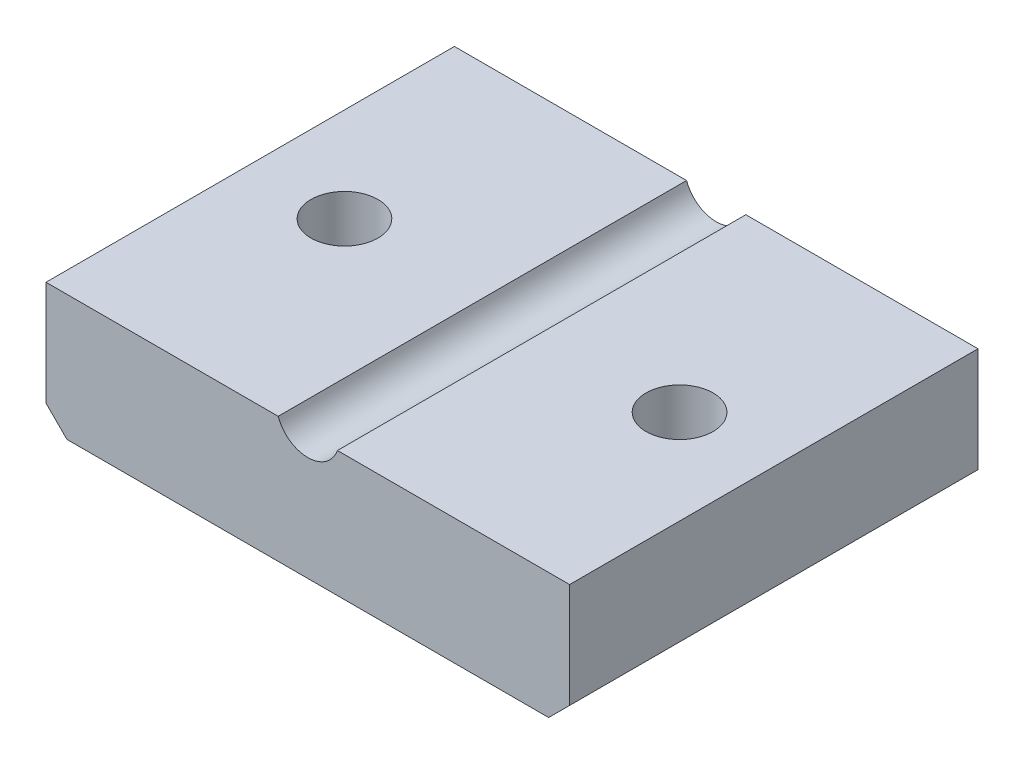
ISO-10303-21;
HEADER;
FILE_DESCRIPTION(('STEP AP214'),'2;1');
FILE_NAME('part.step','',(''),(''),'','','');
FILE_SCHEMA(('AUTOMOTIVE_DESIGN { 1 0 10303 214 1 1 1 1 }'));
ENDSEC;
DATA;
#1=APPLICATION_CONTEXT('core data for automotive mechanical design processes');
#2=APPLICATION_PROTOCOL_DEFINITION('international standard','automotive_design',2000,#1);
#3=PRODUCT_CONTEXT('',#1,'mechanical');
#4=PRODUCT('Part','Part','',(#3));
#5=PRODUCT_RELATED_PRODUCT_CATEGORY('part','',(#4));
#6=PRODUCT_DEFINITION_FORMATION('','',#4);
#7=PRODUCT_DEFINITION_CONTEXT('part definition',#1,'design');
#8=PRODUCT_DEFINITION('design','',#6,#7);
#9=PRODUCT_DEFINITION_SHAPE('','',#8);
#10=(LENGTH_UNIT() NAMED_UNIT(*) SI_UNIT(.MILLI.,.METRE.));
#11=(NAMED_UNIT(*) PLANE_ANGLE_UNIT() SI_UNIT($,.RADIAN.));
#12=(NAMED_UNIT(*) SI_UNIT($,.STERADIAN.) SOLID_ANGLE_UNIT());
#13=UNCERTAINTY_MEASURE_WITH_UNIT(LENGTH_MEASURE(1.E-05),#10,'distance_accuracy_value','');
#14=(GEOMETRIC_REPRESENTATION_CONTEXT(3) GLOBAL_UNCERTAINTY_ASSIGNED_CONTEXT((#13)) GLOBAL_UNIT_ASSIGNED_CONTEXT((#10,
#11,#12)) REPRESENTATION_CONTEXT('',''));
#15=CARTESIAN_POINT('',(0.,0.,0.));
#16=DIRECTION('',(0.,0.,1.));
#17=DIRECTION('',(1.,0.,0.));
#18=AXIS2_PLACEMENT_3D('',#15,#16,#17);
#19=CARTESIAN_POINT('',(-12.5000000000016,-6.5000000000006,-9.74999999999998));
#20=DIRECTION('',(-1.00000000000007,0.,0.));
#21=DIRECTION('',(0.,0.,1.));
#22=AXIS2_PLACEMENT_3D('',#19,#20,#21);
#23=PLANE('',#22);
#24=DIRECTION('',(0.,-1.00000000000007,0.));
#25=VECTOR('',#24,1.);
#26=CARTESIAN_POINT('',(-12.5000000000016,-6.5000000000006,-9.74999999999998));
#27=LINE('',#26,#25);
#28=CARTESIAN_POINT('',(-12.5000000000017,-0.500000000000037,-9.75000000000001));
#29=VERTEX_POINT('',#28);
#30=CARTESIAN_POINT('',(-12.5000000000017,-5.50000000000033,-9.74999999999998));
#31=VERTEX_POINT('',#30);
#32=EDGE_CURVE('E131',#29,#31,#27,.T.);
#33=ORIENTED_EDGE('',*,*,#32,.T.);
#34=DIRECTION('',(0.,0.,1.));
#35=VECTOR('',#34,1.);
#36=CARTESIAN_POINT('',(-12.5000000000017,-5.50000000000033,-9.74999999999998));
#37=LINE('',#36,#35);
#38=CARTESIAN_POINT('',(-12.5000000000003,-5.50000000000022,9.75000000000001));
#39=VERTEX_POINT('',#38);
#40=EDGE_CURVE('E11',#31,#39,#37,.T.);
#41=ORIENTED_EDGE('',*,*,#40,.T.);
#42=DIRECTION('',(0.,-1.00000000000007,0.));
#43=VECTOR('',#42,1.);
#44=CARTESIAN_POINT('',(-12.5000000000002,-6.50000000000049,9.75000000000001));
#45=LINE('',#44,#43);
#46=CARTESIAN_POINT('',(-12.5000000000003,-0.500000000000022,9.75000000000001));
#47=VERTEX_POINT('',#46);
#48=EDGE_CURVE('E223',#47,#39,#45,.T.);
#49=ORIENTED_EDGE('',*,*,#48,.F.);
#50=DIRECTION('',(0.,0.,1.));
#51=VECTOR('',#50,1.);
#52=CARTESIAN_POINT('',(-12.5000000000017,-0.500000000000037,-9.75000000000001));
#53=LINE('',#52,#51);
#54=EDGE_CURVE('E144',#29,#47,#53,.T.);
#55=ORIENTED_EDGE('',*,*,#54,.F.);
#56=EDGE_LOOP('',(#33,#41,#49,#55));
#57=FACE_BOUND('',#56,.T.);
#58=ADVANCED_FACE('F34',(#57),#23,.T.);
#59=CARTESIAN_POINT('',(-12.5000000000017,-0.500000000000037,-9.75000000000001));
#60=DIRECTION('',(0.,1.00000000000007,0.));
#61=DIRECTION('',(-1.00000000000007,0.,0.));
#62=AXIS2_PLACEMENT_3D('',#59,#60,#61);
#63=PLANE('',#62);
#64=CARTESIAN_POINT('',(-8.00000000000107,-0.500000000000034,3.91353616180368E-12));
#65=DIRECTION('',(0.,-1.00000000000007,0.));
#66=DIRECTION('',(0.,0.,-1.));
#67=AXIS2_PLACEMENT_3D('',#64,#65,#66);
#68=CIRCLE('',#67,1.6);
#69=CARTESIAN_POINT('',(-8.00000000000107,-0.500000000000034,-1.59999999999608));
#70=VERTEX_POINT('',#69);
#71=EDGE_CURVE('E210',#70,#70,#68,.T.);
#72=ORIENTED_EDGE('',*,*,#71,.T.);
#73=EDGE_LOOP('',(#72));
#74=FACE_BOUND('',#73,.T.);
#75=ORIENTED_EDGE('',*,*,#54,.T.);
#76=DIRECTION('',(-1.00000000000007,0.,0.));
#77=VECTOR('',#76,1.);
#78=CARTESIAN_POINT('',(-12.5000000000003,-0.500000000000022,9.75000000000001));
#79=LINE('',#78,#77);
#80=CARTESIAN_POINT('',(-1.41421356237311,-0.500000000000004,9.75000000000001));
#81=VERTEX_POINT('',#80);
#82=EDGE_CURVE('E125',#81,#47,#79,.T.);
#83=ORIENTED_EDGE('',*,*,#82,.F.);
#84=DIRECTION('',(0.,0.,1.));
#85=VECTOR('',#84,1.);
#86=CARTESIAN_POINT('',(-1.41421356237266,-0.500000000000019,-9.75000000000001));
#87=LINE('',#86,#85);
#88=CARTESIAN_POINT('',(-1.41421356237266,-0.500000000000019,-9.75000000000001));
#89=VERTEX_POINT('',#88);
#90=EDGE_CURVE('E147',#89,#81,#87,.T.);
#91=ORIENTED_EDGE('',*,*,#90,.F.);
#92=DIRECTION('',(-1.00000000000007,0.,0.));
#93=VECTOR('',#92,1.);
#94=CARTESIAN_POINT('',(-12.5000000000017,-0.500000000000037,-9.75000000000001));
#95=LINE('',#94,#93);
#96=EDGE_CURVE('E120',#89,#29,#95,.T.);
#97=ORIENTED_EDGE('',*,*,#96,.T.);
#98=EDGE_LOOP('',(#75,#83,#91,#97));
#99=FACE_BOUND('',#98,.T.);
#100=ADVANCED_FACE('F177',(#74,#99),#63,.T.);
#101=CARTESIAN_POINT('',(0.,0.,-9.75000000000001));
#102=DIRECTION('',(0.,0.,1.));
#103=DIRECTION('',(1.00000000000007,0.,0.));
#104=AXIS2_PLACEMENT_3D('',#101,#102,#103);
#105=CYLINDRICAL_SURFACE('',#104,1.5);
#106=ORIENTED_EDGE('',*,*,#90,.T.);
#107=CARTESIAN_POINT('',(0.,0.,9.75000000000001));
#108=DIRECTION('',(0.,0.,-1.));
#109=DIRECTION('',(1.00000000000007,0.,0.));
#110=AXIS2_PLACEMENT_3D('',#107,#108,#109);
#111=CIRCLE('',#110,1.5);
#112=CARTESIAN_POINT('',(1.4142135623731,-0.50000000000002,9.75000000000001));
#113=VERTEX_POINT('',#112);
#114=EDGE_CURVE('E123',#113,#81,#111,.T.);
#115=ORIENTED_EDGE('',*,*,#114,.F.);
#116=DIRECTION('',(0.,0.,1.));
#117=VECTOR('',#116,1.);
#118=CARTESIAN_POINT('',(1.41421356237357,-0.500000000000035,-9.75000000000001));
#119=LINE('',#118,#117);
#120=CARTESIAN_POINT('',(1.41421356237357,-0.500000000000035,-9.75000000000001));
#121=VERTEX_POINT('',#120);
#122=EDGE_CURVE('E119',#121,#113,#119,.T.);
#123=ORIENTED_EDGE('',*,*,#122,.F.);
#124=CARTESIAN_POINT('',(0.,0.,-9.75000000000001));
#125=DIRECTION('',(0.,0.,-1.));
#126=DIRECTION('',(1.00000000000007,0.,0.));
#127=AXIS2_PLACEMENT_3D('',#124,#125,#126);
#128=CIRCLE('',#127,1.5);
#129=EDGE_CURVE('E139',#121,#89,#128,.T.);
#130=ORIENTED_EDGE('',*,*,#129,.T.);
#131=EDGE_LOOP('',(#106,#115,#123,#130));
#132=FACE_BOUND('',#131,.T.);
#133=ADVANCED_FACE('F182',(#132),#105,.F.);
#134=CARTESIAN_POINT('',(1.41421356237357,-0.500000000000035,-9.75000000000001));
#135=DIRECTION('',(0.,1.00000000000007,0.));
#136=DIRECTION('',(-1.00000000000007,0.,0.));
#137=AXIS2_PLACEMENT_3D('',#134,#135,#136);
#138=PLANE('',#137);
#139=CARTESIAN_POINT('',(8.00000000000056,-0.500000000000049,0.));
#140=DIRECTION('',(0.,-1.00000000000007,0.));
#141=DIRECTION('',(0.,0.,-1.));
#142=AXIS2_PLACEMENT_3D('',#139,#140,#141);
#143=CIRCLE('',#142,1.6);
#144=CARTESIAN_POINT('',(8.00000000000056,-0.500000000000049,-1.6));
#145=VERTEX_POINT('',#144);
#146=EDGE_CURVE('E220',#145,#145,#143,.T.);
#147=ORIENTED_EDGE('',*,*,#146,.T.);
#148=EDGE_LOOP('',(#147));
#149=FACE_BOUND('',#148,.T.);
#150=ORIENTED_EDGE('',*,*,#122,.T.);
#151=DIRECTION('',(-1.00000000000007,0.,0.));
#152=VECTOR('',#151,1.);
#153=CARTESIAN_POINT('',(1.4142135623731,-0.50000000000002,9.75000000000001));
#154=LINE('',#153,#152);
#155=CARTESIAN_POINT('',(12.5000000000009,-0.500000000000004,9.75000000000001));
#156=VERTEX_POINT('',#155);
#157=EDGE_CURVE('E107',#156,#113,#154,.T.);
#158=ORIENTED_EDGE('',*,*,#157,.F.);
#159=DIRECTION('',(0.,0.,1.));
#160=VECTOR('',#159,1.);
#161=CARTESIAN_POINT('',(12.5000000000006,-0.500000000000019,-9.75000000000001));
#162=LINE('',#161,#160);
#163=CARTESIAN_POINT('',(12.5000000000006,-0.500000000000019,-9.75000000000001));
#164=VERTEX_POINT('',#163);
#165=EDGE_CURVE('E113',#164,#156,#162,.T.);
#166=ORIENTED_EDGE('',*,*,#165,.F.);
#167=DIRECTION('',(-1.00000000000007,0.,0.));
#168=VECTOR('',#167,1.);
#169=CARTESIAN_POINT('',(1.41421356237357,-0.500000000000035,-9.75000000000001));
#170=LINE('',#169,#168);
#171=EDGE_CURVE('E137',#164,#121,#170,.T.);
#172=ORIENTED_EDGE('',*,*,#171,.T.);
#173=EDGE_LOOP('',(#150,#158,#166,#172));
#174=FACE_BOUND('',#173,.T.);
#175=ADVANCED_FACE('F122',(#149,#174),#138,.T.);
#176=CARTESIAN_POINT('',(12.5000000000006,-6.5000000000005,-9.74999999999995));
#177=DIRECTION('',(1.00000000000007,0.,0.));
#178=DIRECTION('',(0.,0.,-1.));
#179=AXIS2_PLACEMENT_3D('',#176,#177,#178);
#180=PLANE('',#179);
#181=DIRECTION('',(0.,1.00000000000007,0.));
#182=VECTOR('',#181,1.);
#183=CARTESIAN_POINT('',(12.5000000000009,-6.50000000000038,9.75000000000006));
#184=LINE('',#183,#182);
#185=CARTESIAN_POINT('',(12.5000000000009,-5.5000000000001,9.75000000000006));
#186=VERTEX_POINT('',#185);
#187=EDGE_CURVE('E101',#186,#156,#184,.T.);
#188=ORIENTED_EDGE('',*,*,#187,.F.);
#189=DIRECTION('',(0.,0.,-1.));
#190=VECTOR('',#189,1.);
#191=CARTESIAN_POINT('',(12.5000000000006,-5.50000000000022,-9.74999999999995));
#192=LINE('',#191,#190);
#193=CARTESIAN_POINT('',(12.5000000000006,-5.50000000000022,-9.74999999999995));
#194=VERTEX_POINT('',#193);
#195=EDGE_CURVE('E57',#186,#194,#192,.T.);
#196=ORIENTED_EDGE('',*,*,#195,.T.);
#197=DIRECTION('',(0.,1.00000000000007,0.));
#198=VECTOR('',#197,1.);
#199=CARTESIAN_POINT('',(12.5000000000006,-6.5000000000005,-9.74999999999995));
#200=LINE('',#199,#198);
#201=EDGE_CURVE('E115',#194,#164,#200,.T.);
#202=ORIENTED_EDGE('',*,*,#201,.T.);
#203=ORIENTED_EDGE('',*,*,#165,.T.);
#204=EDGE_LOOP('',(#188,#196,#202,#203));
#205=FACE_BOUND('',#204,.T.);
#206=ADVANCED_FACE('F114',(#205),#180,.T.);
#207=CARTESIAN_POINT('',(-12.5000000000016,-6.5000000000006,-9.74999999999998));
#208=DIRECTION('',(0.,-1.00000000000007,0.));
#209=DIRECTION('',(0.,0.,-1.));
#210=AXIS2_PLACEMENT_3D('',#207,#208,#209);
#211=PLANE('',#210);
#212=CARTESIAN_POINT('',(-8.00000000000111,-6.50000000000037,0.));
#213=DIRECTION('',(0.,-1.00000000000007,0.));
#214=DIRECTION('',(0.,0.,-1.));
#215=AXIS2_PLACEMENT_3D('',#212,#213,#214);
#216=CIRCLE('',#215,1.59999999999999);
#217=CARTESIAN_POINT('',(-8.00000000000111,-6.50000000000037,-1.59999999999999));
#218=VERTEX_POINT('',#217);
#219=EDGE_CURVE('E213',#218,#218,#216,.T.);
#220=ORIENTED_EDGE('',*,*,#219,.F.);
#221=EDGE_LOOP('',(#220));
#222=FACE_BOUND('',#221,.T.);
#223=CARTESIAN_POINT('',(8.00000000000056,-6.50000000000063,0.));
#224=DIRECTION('',(0.,-1.00000000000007,0.));
#225=DIRECTION('',(0.,0.,-1.));
#226=AXIS2_PLACEMENT_3D('',#223,#224,#225);
#227=CIRCLE('',#226,1.59999999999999);
#228=CARTESIAN_POINT('',(8.00000000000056,-6.50000000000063,-1.59999999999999));
#229=VERTEX_POINT('',#228);
#230=EDGE_CURVE('E215',#229,#229,#227,.T.);
#231=ORIENTED_EDGE('',*,*,#230,.F.);
#232=EDGE_LOOP('',(#231));
#233=FACE_BOUND('',#232,.T.);
#234=DIRECTION('',(1.00000000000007,0.,0.));
#235=VECTOR('',#234,1.);
#236=CARTESIAN_POINT('',(-12.5000000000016,-6.5000000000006,-9.74999999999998));
#237=LINE('',#236,#235);
#238=CARTESIAN_POINT('',(-11.5000000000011,-6.50000000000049,-9.74999999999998));
#239=VERTEX_POINT('',#238);
#240=CARTESIAN_POINT('',(11.5000000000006,-6.50000000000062,-9.74999999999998));
#241=VERTEX_POINT('',#240);
#242=EDGE_CURVE('E133',#239,#241,#237,.T.);
#243=ORIENTED_EDGE('',*,*,#242,.T.);
#244=DIRECTION('',(0.,0.,1.));
#245=VECTOR('',#244,1.);
#246=CARTESIAN_POINT('',(11.5000000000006,-6.50000000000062,-9.74999999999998));
#247=LINE('',#246,#245);
#248=CARTESIAN_POINT('',(11.5000000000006,-6.5000000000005,9.75000000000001));
#249=VERTEX_POINT('',#248);
#250=EDGE_CURVE('E151',#241,#249,#247,.T.);
#251=ORIENTED_EDGE('',*,*,#250,.T.);
#252=DIRECTION('',(1.00000000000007,0.,0.));
#253=VECTOR('',#252,1.);
#254=CARTESIAN_POINT('',(-12.5000000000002,-6.50000000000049,9.75000000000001));
#255=LINE('',#254,#253);
#256=CARTESIAN_POINT('',(-11.500000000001,-6.50000000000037,9.75000000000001));
#257=VERTEX_POINT('',#256);
#258=EDGE_CURVE('E110',#257,#249,#255,.T.);
#259=ORIENTED_EDGE('',*,*,#258,.F.);
#260=DIRECTION('',(0.,0.,-1.));
#261=VECTOR('',#260,1.);
#262=CARTESIAN_POINT('',(-11.5000000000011,-6.50000000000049,-9.74999999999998));
#263=LINE('',#262,#261);
#264=EDGE_CURVE('E146',#257,#239,#263,.T.);
#265=ORIENTED_EDGE('',*,*,#264,.T.);
#266=EDGE_LOOP('',(#243,#251,#259,#265));
#267=FACE_BOUND('',#266,.T.);
#268=ADVANCED_FACE('F163',(#222,#233,#267),#211,.T.);
#269=CARTESIAN_POINT('',(0.,0.,-9.75000000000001));
#270=DIRECTION('',(0.,0.,1.));
#271=DIRECTION('',(1.00000000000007,0.,0.));
#272=AXIS2_PLACEMENT_3D('',#269,#270,#271);
#273=PLANE('',#272);
#274=ORIENTED_EDGE('',*,*,#201,.F.);
#275=DIRECTION('',(0.707106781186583,0.707106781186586,0.));
#276=VECTOR('',#275,1.);
#277=CARTESIAN_POINT('',(11.5000000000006,-6.50000000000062,-9.74999999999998));
#278=LINE('',#277,#276);
#279=EDGE_CURVE('E42',#194,#241,#278,.F.);
#280=ORIENTED_EDGE('',*,*,#279,.T.);
#281=ORIENTED_EDGE('',*,*,#242,.F.);
#282=DIRECTION('',(0.707106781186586,-0.707106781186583,0.));
#283=VECTOR('',#282,1.);
#284=CARTESIAN_POINT('',(-12.5000000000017,-5.50000000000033,-9.74999999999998));
#285=LINE('',#284,#283);
#286=EDGE_CURVE('E49',#239,#31,#285,.F.);
#287=ORIENTED_EDGE('',*,*,#286,.T.);
#288=ORIENTED_EDGE('',*,*,#32,.F.);
#289=ORIENTED_EDGE('',*,*,#96,.F.);
#290=ORIENTED_EDGE('',*,*,#129,.F.);
#291=ORIENTED_EDGE('',*,*,#171,.F.);
#292=EDGE_LOOP('',(#274,#280,#281,#287,#288,#289,#290,#291));
#293=FACE_BOUND('',#292,.T.);
#294=ADVANCED_FACE('F159',(#293),#273,.F.);
#295=CARTESIAN_POINT('',(0.,0.,9.75000000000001));
#296=DIRECTION('',(0.,0.,1.));
#297=DIRECTION('',(1.00000000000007,0.,0.));
#298=AXIS2_PLACEMENT_3D('',#295,#296,#297);
#299=PLANE('',#298);
#300=ORIENTED_EDGE('',*,*,#258,.T.);
#301=DIRECTION('',(-0.707106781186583,-0.707106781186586,0.));
#302=VECTOR('',#301,1.);
#303=CARTESIAN_POINT('',(9.00000000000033,-9.00000000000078,9.75000000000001));
#304=LINE('',#303,#302);
#305=EDGE_CURVE('E109',#249,#186,#304,.F.);
#306=ORIENTED_EDGE('',*,*,#305,.T.);
#307=ORIENTED_EDGE('',*,*,#187,.T.);
#308=ORIENTED_EDGE('',*,*,#157,.T.);
#309=ORIENTED_EDGE('',*,*,#114,.T.);
#310=ORIENTED_EDGE('',*,*,#82,.T.);
#311=ORIENTED_EDGE('',*,*,#48,.T.);
#312=DIRECTION('',(-0.707106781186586,0.707106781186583,0.));
#313=VECTOR('',#312,1.);
#314=CARTESIAN_POINT('',(-9.00000000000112,-9.00000000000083,9.75000000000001));
#315=LINE('',#314,#313);
#316=EDGE_CURVE('E154',#39,#257,#315,.F.);
#317=ORIENTED_EDGE('',*,*,#316,.T.);
#318=EDGE_LOOP('',(#300,#306,#307,#308,#309,#310,#311,#317));
#319=FACE_BOUND('',#318,.T.);
#320=ADVANCED_FACE('F104',(#319),#299,.T.);
#321=CARTESIAN_POINT('',(11.5000000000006,-6.50000000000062,-9.74999999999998));
#322=DIRECTION('',(-0.707106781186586,0.707106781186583,0.));
#323=DIRECTION('',(-0.707106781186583,-0.707106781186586,0.));
#324=AXIS2_PLACEMENT_3D('',#321,#322,#323);
#325=PLANE('',#324);
#326=ORIENTED_EDGE('',*,*,#279,.F.);
#327=ORIENTED_EDGE('',*,*,#195,.F.);
#328=ORIENTED_EDGE('',*,*,#305,.F.);
#329=ORIENTED_EDGE('',*,*,#250,.F.);
#330=EDGE_LOOP('',(#326,#327,#328,#329));
#331=FACE_BOUND('',#330,.T.);
#332=ADVANCED_FACE('F166',(#331),#325,.F.);
#333=CARTESIAN_POINT('',(-12.5000000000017,-5.50000000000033,-9.74999999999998));
#334=DIRECTION('',(0.707106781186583,0.707106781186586,0.));
#335=DIRECTION('',(-0.707106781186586,0.707106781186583,0.));
#336=AXIS2_PLACEMENT_3D('',#333,#334,#335);
#337=PLANE('',#336);
#338=ORIENTED_EDGE('',*,*,#286,.F.);
#339=ORIENTED_EDGE('',*,*,#264,.F.);
#340=ORIENTED_EDGE('',*,*,#316,.F.);
#341=ORIENTED_EDGE('',*,*,#40,.F.);
#342=EDGE_LOOP('',(#338,#339,#340,#341));
#343=FACE_BOUND('',#342,.T.);
#344=ADVANCED_FACE('F36',(#343),#337,.F.);
#345=CARTESIAN_POINT('',(8.00000000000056,-6.50000000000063,0.));
#346=DIRECTION('',(0.,-1.00000000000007,0.));
#347=DIRECTION('',(0.,0.,-1.));
#348=AXIS2_PLACEMENT_3D('',#345,#346,#347);
#349=CYLINDRICAL_SURFACE('',#348,1.59999999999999);
#350=ORIENTED_EDGE('',*,*,#146,.F.);
#351=EDGE_LOOP('',(#350));
#352=FACE_BOUND('',#351,.T.);
#353=ORIENTED_EDGE('',*,*,#230,.T.);
#354=EDGE_LOOP('',(#353));
#355=FACE_BOUND('',#354,.T.);
#356=ADVANCED_FACE('F172',(#352,#355),#349,.F.);
#357=CARTESIAN_POINT('',(-8.00000000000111,-6.50000000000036,0.));
#358=DIRECTION('',(0.,-1.00000000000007,0.));
#359=DIRECTION('',(0.,0.,-1.));
#360=AXIS2_PLACEMENT_3D('',#357,#358,#359);
#361=CYLINDRICAL_SURFACE('',#360,1.59999999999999);
#362=ORIENTED_EDGE('',*,*,#71,.F.);
#363=EDGE_LOOP('',(#362));
#364=FACE_BOUND('',#363,.T.);
#365=ORIENTED_EDGE('',*,*,#219,.T.);
#366=EDGE_LOOP('',(#365));
#367=FACE_BOUND('',#366,.T.);
#368=ADVANCED_FACE('F201',(#364,#367),#361,.F.);
#369=CLOSED_SHELL('',(#58,#100,#133,#175,#206,#268,#294,#320,#332,#344,#356,#368));
#370=MANIFOLD_SOLID_BREP('B2',#369);
#371=ADVANCED_BREP_SHAPE_REPRESENTATION('',(#18,#370),#14);
#372=SHAPE_DEFINITION_REPRESENTATION(#9,#371);
ENDSEC;
END-ISO-10303-21;
